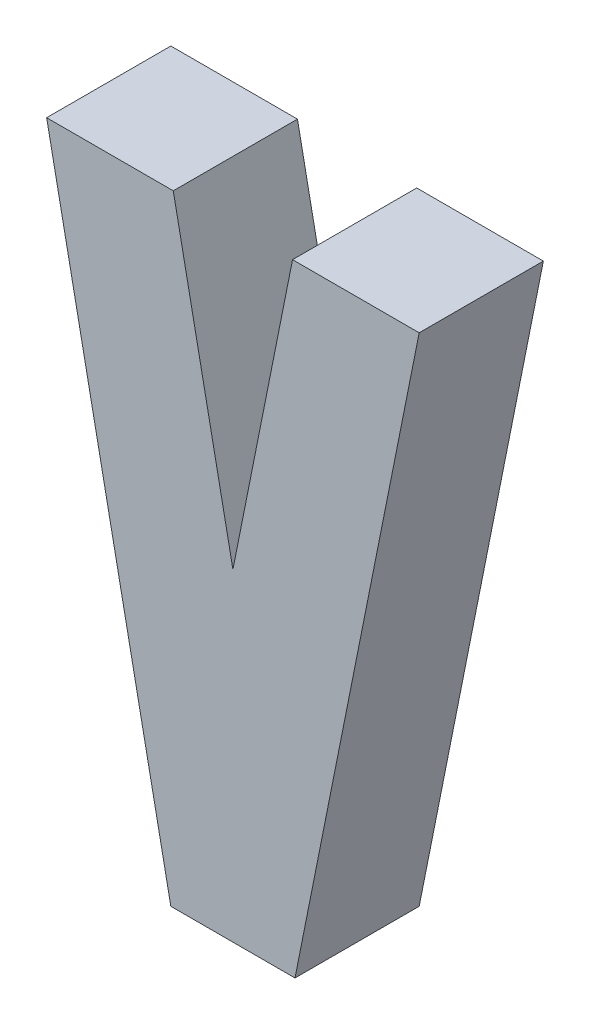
from build123d import *

# Parameters (mm, degrees)
BOSS_EXTRU_1_DEPTH = 10


with BuildPart() as part:
    # Esquisse1 → Boss.-Extru.1 (new body)
    with BuildSketch(Plane.XY):
        Polygon((0, 50), (10, 0), (20, 0), (30, 50), (19.801960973, 50), (15, 25.990195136), (10.198039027, 50), align=None)
    extrude(amount=BOSS_EXTRU_1_DEPTH)


solid = part.part
